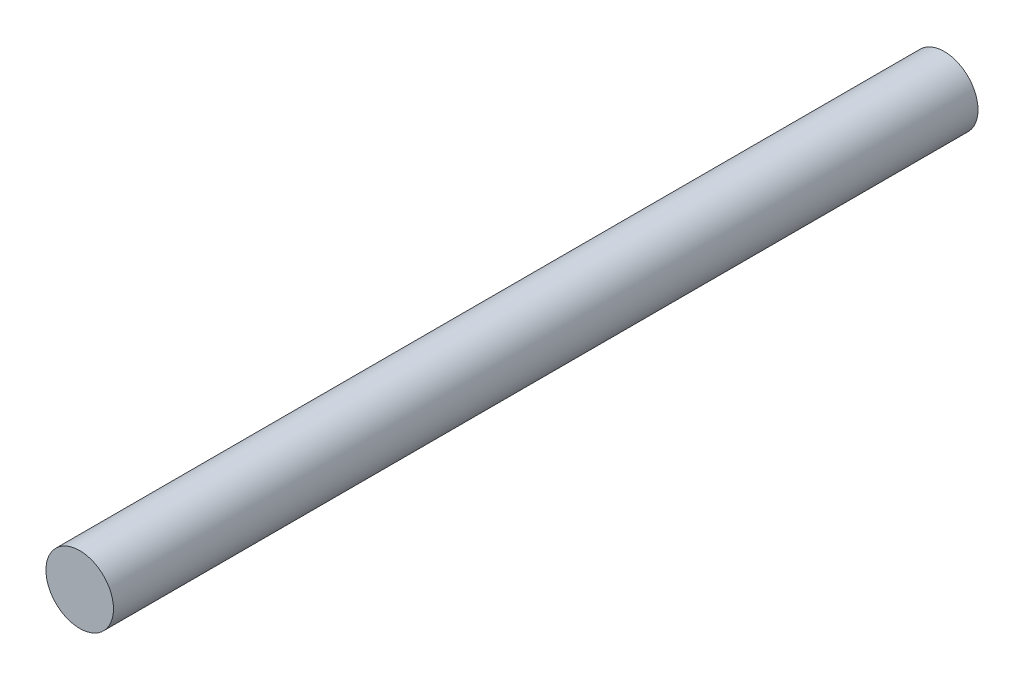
ISO-10303-21;
HEADER;
FILE_DESCRIPTION(('STEP AP214'),'2;1');
FILE_NAME('part.step','',(''),(''),'','','');
FILE_SCHEMA(('AUTOMOTIVE_DESIGN { 1 0 10303 214 1 1 1 1 }'));
ENDSEC;
DATA;
#1=APPLICATION_CONTEXT('core data for automotive mechanical design processes');
#2=APPLICATION_PROTOCOL_DEFINITION('international standard','automotive_design',2000,#1);
#3=PRODUCT_CONTEXT('',#1,'mechanical');
#4=PRODUCT('Part','Part','',(#3));
#5=PRODUCT_RELATED_PRODUCT_CATEGORY('part','',(#4));
#6=PRODUCT_DEFINITION_FORMATION('','',#4);
#7=PRODUCT_DEFINITION_CONTEXT('part definition',#1,'design');
#8=PRODUCT_DEFINITION('design','',#6,#7);
#9=PRODUCT_DEFINITION_SHAPE('','',#8);
#10=(LENGTH_UNIT() NAMED_UNIT(*) SI_UNIT(.MILLI.,.METRE.));
#11=(NAMED_UNIT(*) PLANE_ANGLE_UNIT() SI_UNIT($,.RADIAN.));
#12=(NAMED_UNIT(*) SI_UNIT($,.STERADIAN.) SOLID_ANGLE_UNIT());
#13=UNCERTAINTY_MEASURE_WITH_UNIT(LENGTH_MEASURE(1.E-05),#10,'distance_accuracy_value','');
#14=(GEOMETRIC_REPRESENTATION_CONTEXT(3) GLOBAL_UNCERTAINTY_ASSIGNED_CONTEXT((#13)) GLOBAL_UNIT_ASSIGNED_CONTEXT((#10,
#11,#12)) REPRESENTATION_CONTEXT('',''));
#15=CARTESIAN_POINT('',(0.,0.,0.));
#16=DIRECTION('',(0.,0.,1.));
#17=DIRECTION('',(1.,0.,0.));
#18=AXIS2_PLACEMENT_3D('',#15,#16,#17);
#19=CARTESIAN_POINT('',(0.,0.,0.));
#20=DIRECTION('',(0.,0.,-1.));
#21=DIRECTION('',(1.,0.,0.));
#22=AXIS2_PLACEMENT_3D('',#19,#20,#21);
#23=CYLINDRICAL_SURFACE('',#22,2.5);
#24=CARTESIAN_POINT('',(0.,0.,0.));
#25=DIRECTION('',(0.,0.,-1.));
#26=DIRECTION('',(1.,0.,0.));
#27=AXIS2_PLACEMENT_3D('',#24,#25,#26);
#28=CIRCLE('',#27,2.5);
#29=CARTESIAN_POINT('',(2.5,0.,0.));
#30=VERTEX_POINT('',#29);
#31=EDGE_CURVE('E8',#30,#30,#28,.T.);
#32=ORIENTED_EDGE('',*,*,#31,.F.);
#33=EDGE_LOOP('',(#32));
#34=FACE_BOUND('',#33,.T.);
#35=CARTESIAN_POINT('',(0.,0.,64.));
#36=DIRECTION('',(0.,0.,-1.));
#37=DIRECTION('',(1.,0.,0.));
#38=AXIS2_PLACEMENT_3D('',#35,#36,#37);
#39=CIRCLE('',#38,2.5);
#40=CARTESIAN_POINT('',(2.5,0.,64.));
#41=VERTEX_POINT('',#40);
#42=EDGE_CURVE('E18',#41,#41,#39,.T.);
#43=ORIENTED_EDGE('',*,*,#42,.T.);
#44=EDGE_LOOP('',(#43));
#45=FACE_BOUND('',#44,.T.);
#46=ADVANCED_FACE('F12',(#34,#45),#23,.T.);
#47=CARTESIAN_POINT('',(0.,-2.5,0.));
#48=DIRECTION('',(0.,0.,1.));
#49=DIRECTION('',(-1.,0.,0.));
#50=AXIS2_PLACEMENT_3D('',#47,#48,#49);
#51=PLANE('',#50);
#52=ORIENTED_EDGE('',*,*,#31,.T.);
#53=EDGE_LOOP('',(#52));
#54=FACE_BOUND('',#53,.T.);
#55=ADVANCED_FACE('F27',(#54),#51,.F.);
#56=CARTESIAN_POINT('',(0.,0.,64.));
#57=DIRECTION('',(0.,0.,-1.));
#58=DIRECTION('',(1.,0.,0.));
#59=AXIS2_PLACEMENT_3D('',#56,#57,#58);
#60=PLANE('',#59);
#61=ORIENTED_EDGE('',*,*,#42,.F.);
#62=EDGE_LOOP('',(#61));
#63=FACE_BOUND('',#62,.T.);
#64=ADVANCED_FACE('F25',(#63),#60,.F.);
#65=CLOSED_SHELL('',(#46,#55,#64));
#66=MANIFOLD_SOLID_BREP('B1',#65);
#67=ADVANCED_BREP_SHAPE_REPRESENTATION('',(#18,#66),#14);
#68=SHAPE_DEFINITION_REPRESENTATION(#9,#67);
ENDSEC;
END-ISO-10303-21;
